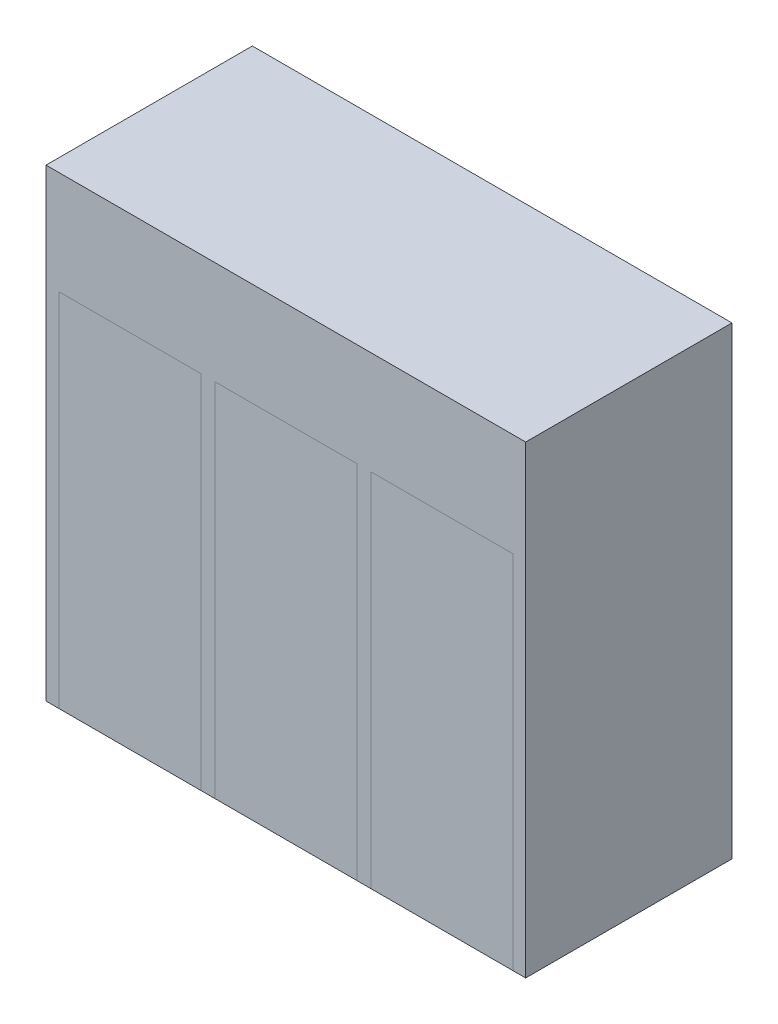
from build123d import *

# Parameters (mm, degrees)
SKIZZE1_W                         = 18.6
SKIZZE1_H                         = 18
AUFSATZ_LINEAR_AUSTRAGEN1_DEPTH   = 8
SKIZZE2_W                         = 5.5
SKIZZE2_H                         = 14
SCHNITT_LINEAR_AUSTRAGEN1_DEPTH   = 1
SKIZZE3_W                         = 5.5
SKIZZE3_H                         = 14
AUFSATZ_LINEAR_AUSTRAGEN2_DEPTH   = 1
AUFSATZ_LINEAR_AUSTRAGEN2_2_DEPTH = 1
AUFSATZ_LINEAR_AUSTRAGEN2_3_DEPTH = 1


with BuildPart() as part:
    # Skizze1 → Aufsatz-Linear austragen1 (new body)
    with BuildSketch(Plane.XY):
        with Locations((0.8386358, -3.546101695)):
            Rectangle(SKIZZE1_W, SKIZZE1_H)
    extrude(amount=AUFSATZ_LINEAR_AUSTRAGEN1_DEPTH)

    # Skizze2 → Schnitt-Linear austragen1 (cut)
    with BuildSketch(Plane.XY.offset(8)):
        with Locations((-5.2113642, -5.546101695)):
            Rectangle(SKIZZE2_W, SKIZZE2_H)
        with Locations((0.8386358, -5.546101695)):
            Rectangle(SKIZZE2_W, SKIZZE2_H)
        with Locations((6.8886358, -5.546101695)):
            Rectangle(SKIZZE2_W, SKIZZE2_H)
    extrude(amount=-SCHNITT_LINEAR_AUSTRAGEN1_DEPTH, mode=Mode.SUBTRACT)


with BuildPart() as body_2:
    # Skizze3 → Aufsatz-Linear austragen2 (new body)
    with BuildSketch(Plane.XY.offset(7)):
        with Locations((-5.2113642, -5.546101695)):
            Rectangle(SKIZZE3_W, SKIZZE3_H)
    extrude(amount=AUFSATZ_LINEAR_AUSTRAGEN2_DEPTH)


with BuildPart() as body_3:
    # Skizze3 → Aufsatz-Linear austragen2 2 (new body)
    with BuildSketch(Plane.XY.offset(7)):
        with Locations((0.8386358, -5.546101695)):
            Rectangle(SKIZZE3_W, SKIZZE3_H)
    extrude(amount=AUFSATZ_LINEAR_AUSTRAGEN2_2_DEPTH)


with BuildPart() as body_4:
    # Skizze3 → Aufsatz-Linear austragen2 3 (new body)
    with BuildSketch(Plane.XY.offset(7)):
        with Locations((6.8886358, -5.546101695)):
            Rectangle(SKIZZE3_W, SKIZZE3_H)
    extrude(amount=AUFSATZ_LINEAR_AUSTRAGEN2_3_DEPTH)


solid = Compound([part.part, body_2.part, body_3.part, body_4.part])
